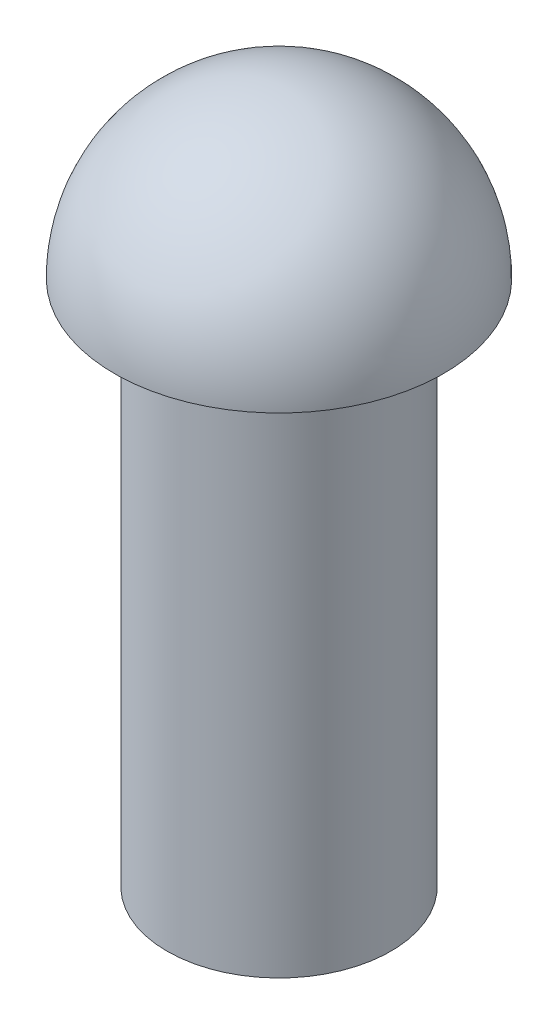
ISO-10303-21;
HEADER;
FILE_DESCRIPTION(('STEP AP214'),'2;1');
FILE_NAME('part.step','',(''),(''),'','','');
FILE_SCHEMA(('AUTOMOTIVE_DESIGN { 1 0 10303 214 1 1 1 1 }'));
ENDSEC;
DATA;
#1=APPLICATION_CONTEXT('core data for automotive mechanical design processes');
#2=APPLICATION_PROTOCOL_DEFINITION('international standard','automotive_design',2000,#1);
#3=PRODUCT_CONTEXT('',#1,'mechanical');
#4=PRODUCT('Part','Part','',(#3));
#5=PRODUCT_RELATED_PRODUCT_CATEGORY('part','',(#4));
#6=PRODUCT_DEFINITION_FORMATION('','',#4);
#7=PRODUCT_DEFINITION_CONTEXT('part definition',#1,'design');
#8=PRODUCT_DEFINITION('design','',#6,#7);
#9=PRODUCT_DEFINITION_SHAPE('','',#8);
#10=(LENGTH_UNIT() NAMED_UNIT(*) SI_UNIT(.MILLI.,.METRE.));
#11=(NAMED_UNIT(*) PLANE_ANGLE_UNIT() SI_UNIT($,.RADIAN.));
#12=(NAMED_UNIT(*) SI_UNIT($,.STERADIAN.) SOLID_ANGLE_UNIT());
#13=UNCERTAINTY_MEASURE_WITH_UNIT(LENGTH_MEASURE(1.E-05),#10,'distance_accuracy_value','');
#14=(GEOMETRIC_REPRESENTATION_CONTEXT(3) GLOBAL_UNCERTAINTY_ASSIGNED_CONTEXT((#13)) GLOBAL_UNIT_ASSIGNED_CONTEXT((#10,
#11,#12)) REPRESENTATION_CONTEXT('',''));
#15=CARTESIAN_POINT('',(0.,0.,0.));
#16=DIRECTION('',(0.,0.,1.));
#17=DIRECTION('',(1.,0.,0.));
#18=AXIS2_PLACEMENT_3D('',#15,#16,#17);
#19=CARTESIAN_POINT('',(0.883999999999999,-4.,0.883999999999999));
#20=DIRECTION('',(0.,-1.,0.));
#21=DIRECTION('',(-1.,0.,0.));
#22=AXIS2_PLACEMENT_3D('',#19,#20,#21);
#23=PLANE('',#22);
#24=CARTESIAN_POINT('',(0.,-4.,0.));
#25=DIRECTION('',(0.,-1.,0.));
#26=DIRECTION('',(0.,0.,-1.));
#27=AXIS2_PLACEMENT_3D('',#24,#25,#26);
#28=CIRCLE('',#27,0.85);
#29=CARTESIAN_POINT('',(0.,-4.,-0.85));
#30=VERTEX_POINT('',#29);
#31=EDGE_CURVE('E20',#30,#30,#28,.T.);
#32=ORIENTED_EDGE('',*,*,#31,.T.);
#33=EDGE_LOOP('',(#32));
#34=FACE_BOUND('',#33,.T.);
#35=ADVANCED_FACE('F16',(#34),#23,.T.);
#36=CARTESIAN_POINT('',(0.,1.25,0.));
#37=CARTESIAN_POINT('',(-0.750604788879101,1.24999999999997,0.));
#38=CARTESIAN_POINT('',(-1.27296026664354,0.710970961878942,0.));
#39=CARTESIAN_POINT('',(-1.24938320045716,-0.0392634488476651,0.));
#40=(BOUNDED_CURVE() B_SPLINE_CURVE(3,(#36,#37,#38,#39),.UNSPECIFIED.,.F.,
.F.) B_SPLINE_CURVE_WITH_KNOTS((4,4),(0.,1.),
.UNSPECIFIED.) CURVE() GEOMETRIC_REPRESENTATION_ITEM() RATIONAL_B_SPLINE_CURVE((1.,
0.797275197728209,0.797275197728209,1.)) REPRESENTATION_ITEM(''));
#41=CARTESIAN_POINT('',(0.,0.,0.));
#42=DIRECTION('',(0.,-1.,0.));
#43=AXIS1_PLACEMENT('',#41,#42);
#44=SURFACE_OF_REVOLUTION('',#40,#43);
#45=CARTESIAN_POINT('',(0.,1.25,0.));
#46=VERTEX_POINT('',#45);
#47=VERTEX_LOOP('',#46);
#48=FACE_BOUND('',#47,.T.);
#49=CARTESIAN_POINT('',(0.,0.,0.));
#50=DIRECTION('',(0.,-1.,0.));
#51=DIRECTION('',(0.,0.,-1.));
#52=AXIS2_PLACEMENT_3D('',#49,#50,#51);
#53=CIRCLE('',#52,1.25);
#54=CARTESIAN_POINT('',(0.,0.,-1.25));
#55=VERTEX_POINT('',#54);
#56=EDGE_CURVE('E24',#55,#55,#53,.F.);
#57=ORIENTED_EDGE('',*,*,#56,.T.);
#58=EDGE_LOOP('',(#57));
#59=FACE_BOUND('',#58,.T.);
#60=ADVANCED_FACE('F28',(#48,#59),#44,.T.);
#61=CARTESIAN_POINT('',(0.,0.,0.));
#62=DIRECTION('',(0.,-1.,0.));
#63=DIRECTION('',(0.,0.,-1.));
#64=AXIS2_PLACEMENT_3D('',#61,#62,#63);
#65=CYLINDRICAL_SURFACE('',#64,0.85);
#66=ORIENTED_EDGE('',*,*,#31,.F.);
#67=EDGE_LOOP('',(#66));
#68=FACE_BOUND('',#67,.T.);
#69=CARTESIAN_POINT('',(0.,0.,0.));
#70=DIRECTION('',(0.,-1.,0.));
#71=DIRECTION('',(0.,0.,-1.));
#72=AXIS2_PLACEMENT_3D('',#69,#70,#71);
#73=CIRCLE('',#72,0.85);
#74=CARTESIAN_POINT('',(0.,0.,-0.85));
#75=VERTEX_POINT('',#74);
#76=EDGE_CURVE('E11',#75,#75,#73,.T.);
#77=ORIENTED_EDGE('',*,*,#76,.T.);
#78=EDGE_LOOP('',(#77));
#79=FACE_BOUND('',#78,.T.);
#80=ADVANCED_FACE('F31',(#68,#79),#65,.T.);
#81=CARTESIAN_POINT('',(1.3,0.,1.3));
#82=DIRECTION('',(0.,-1.,0.));
#83=DIRECTION('',(-1.,0.,0.));
#84=AXIS2_PLACEMENT_3D('',#81,#82,#83);
#85=PLANE('',#84);
#86=ORIENTED_EDGE('',*,*,#76,.F.);
#87=EDGE_LOOP('',(#86));
#88=FACE_BOUND('',#87,.T.);
#89=ORIENTED_EDGE('',*,*,#56,.F.);
#90=EDGE_LOOP('',(#89));
#91=FACE_BOUND('',#90,.T.);
#92=ADVANCED_FACE('F18',(#88,#91),#85,.T.);
#93=CLOSED_SHELL('',(#35,#60,#80,#92));
#94=MANIFOLD_SOLID_BREP('B1',#93);
#95=ADVANCED_BREP_SHAPE_REPRESENTATION('',(#18,#94),#14);
#96=SHAPE_DEFINITION_REPRESENTATION(#9,#95);
ENDSEC;
END-ISO-10303-21;
